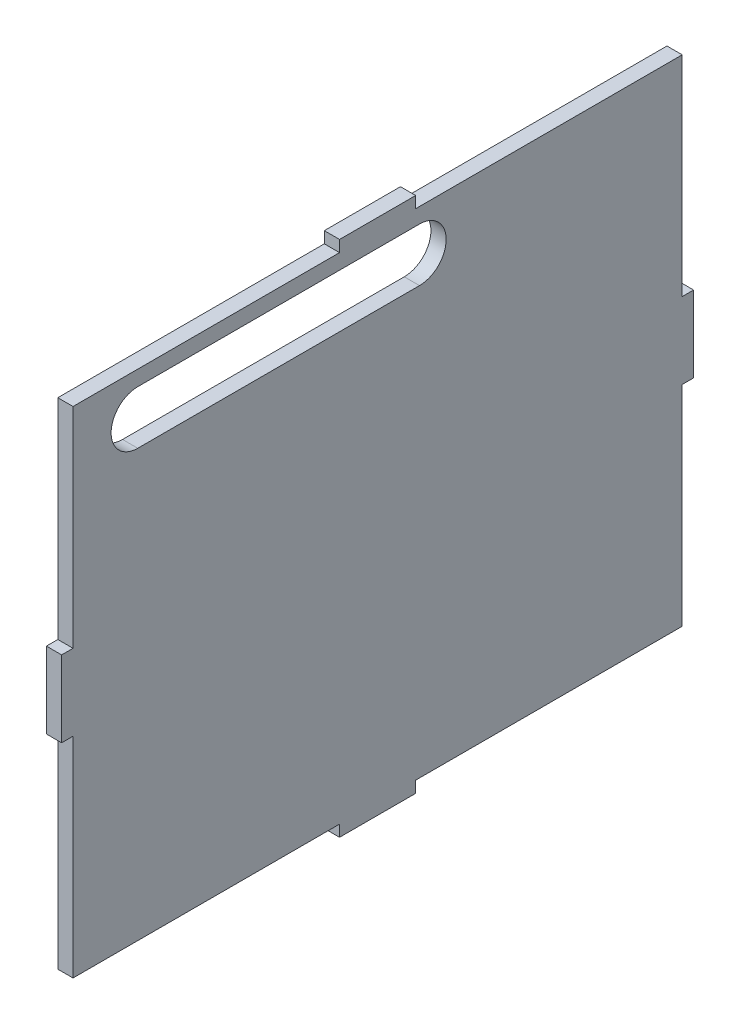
from build123d import *

# Parameters (mm, degrees)
ESQUISSE1_W        = 1.5
ESQUISSE1_H        = 10
ESQUISSE1_W_2      = 10
ESQUISSE1_H_2      = 1.5
BOSS_EXTRU_1_DEPTH = 2


with BuildPart() as part:
    # Esquisse1 → Boss.-Extru.1 (new body)
    # profile 1 of 5: a face of its own
    with BuildSketch(Plane(origin=(0, 0, 0), x_dir=(0, 0, 1), z_dir=(1, 0, 0))):
        Polygon((35, 65), (0, 65), (0, 37.5), (0, 27.5), (0, 0), (35, 0), (45, 0), (80, 0), (80, 27.5), (80, 37.5), (80, 65), (45, 65), align=None)
        with BuildLine():
            ThreePointArc((34.5, 2), (31, 5.5), (34.5, 9))
            Line((34.5, 9), (71.5, 9))
            ThreePointArc((71.5, 9), (73.974873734, 7.974873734), (75, 5.5))
            ThreePointArc((75, 5.5), (73.974873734, 3.025126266), (71.5, 2))
            Line((71.5, 2), (34.5, 2))
        make_face(mode=Mode.SUBTRACT)
    # profile 2 of 5: a face of its own
    with BuildSketch(Plane(origin=(0, 0, 0), x_dir=(0, 0, 1), z_dir=(1, 0, 0))):
        with Locations((80.75, 32.5)):
            Rectangle(ESQUISSE1_W, ESQUISSE1_H)
    # profile 3 of 5: a face of its own
    with BuildSketch(Plane(origin=(0, 0, 0), x_dir=(0, 0, 1), z_dir=(1, 0, 0))):
        with Locations((40, 65.75)):
            Rectangle(ESQUISSE1_W_2, ESQUISSE1_H_2)
    # profile 4 of 5: a face of its own
    with BuildSketch(Plane(origin=(0, 0, 0), x_dir=(0, 0, 1), z_dir=(1, 0, 0))):
        with Locations((-0.75, 32.5)):
            Rectangle(ESQUISSE1_W, ESQUISSE1_H)
    # profile 5 of 5: a face of its own
    with BuildSketch(Plane(origin=(0, 0, 0), x_dir=(0, 0, 1), z_dir=(1, 0, 0))):
        with Locations((40, -0.75)):
            Rectangle(ESQUISSE1_W_2, ESQUISSE1_H_2)
    extrude(amount=BOSS_EXTRU_1_DEPTH)


solid = part.part
